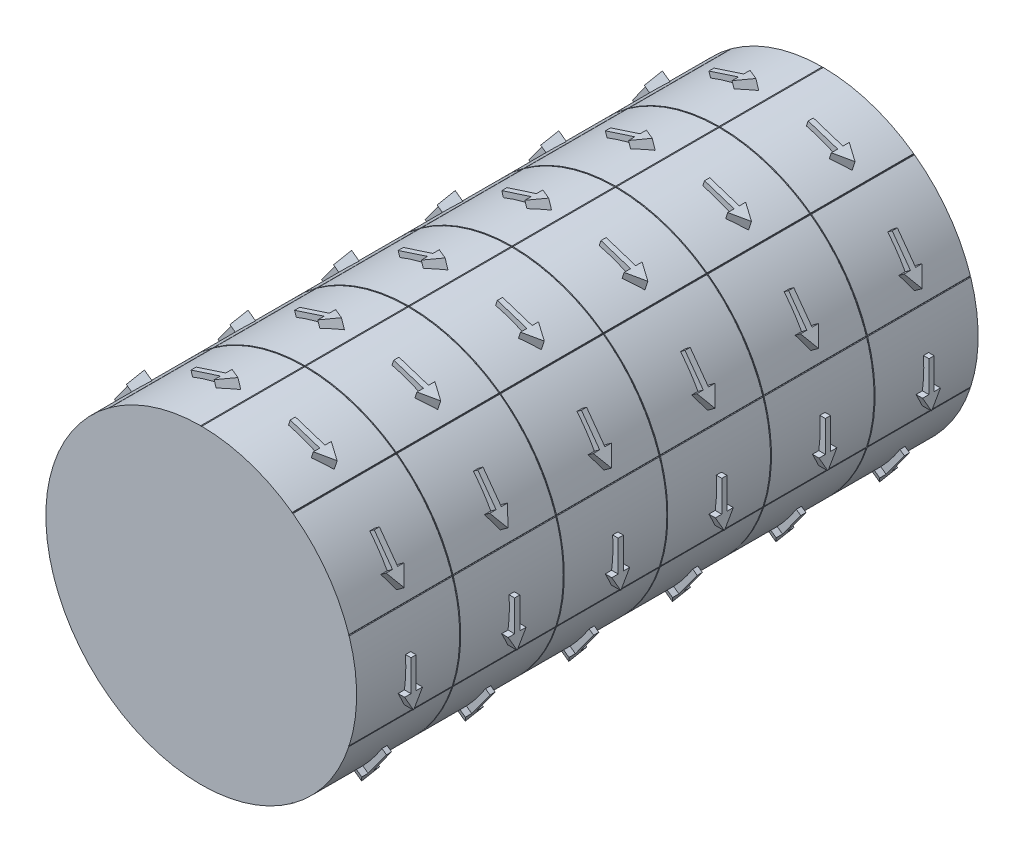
from build123d import *

# Parameters (mm, degrees)
ESQUISSE2_R                          = 15
BOSS_EXTRU_1_DEPTH                   = 60
ENL_V_MAT_EXTRU_1_DEPTH              = 64.639610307
R_P_TITION_CIRCULAIRE1_COUNT         = 10
ESQUISSE4_W                          = 0.1
ESQUISSE4_H                          = 0.1
R_P_TITION_LIN_AIRE1_COUNT           = 5
R_P_TITION_LIN_AIRE1_PITCH           = 10
BOSS_EXTRU_2_START                   = -1
BOSS_EXTRU_2_DEPTH                   = 1.5
R_P_TITION_LIN_AIRE2_COUNT           = 6
R_P_TITION_LIN_AIRE2_PITCH           = 10
R_P_TITION_CIRCULAIRE2_COUNT         = 10
R_P_TITION_START                     = -1
R_P_TITION_CIRCULAIRE2_COPY_1_DEPTH  = 1.5
R_P_TITION_CIRCULAIRE2_COPY_2_DEPTH  = 1.5
R_P_TITION_CIRCULAIRE2_COPY_3_DEPTH  = 1.5
R_P_TITION_CIRCULAIRE2_COPY_4_DEPTH  = 1.5
R_P_TITION_CIRCULAIRE2_COPY_5_DEPTH  = 1.5
R_P_TITION_CIRCULAIRE2_COPY_6_DEPTH  = 1.5
R_P_TITION_CIRCULAIRE2_COPY_7_DEPTH  = 1.5
R_P_TITION_CIRCULAIRE2_COPY_8_DEPTH  = 1.5
R_P_TITION_CIRCULAIRE2_COPY_9_DEPTH  = 1.5
R_P_TITION_CIRCULAIRE2_COPY_10_DEPTH = 1.5
R_P_TITION_CIRCULAIRE2_COPY_11_DEPTH = 1.5
R_P_TITION_CIRCULAIRE2_COPY_12_DEPTH = 1.5
R_P_TITION_CIRCULAIRE2_COPY_13_DEPTH = 1.5
R_P_TITION_CIRCULAIRE2_COPY_14_DEPTH = 1.5
R_P_TITION_CIRCULAIRE2_COPY_15_DEPTH = 1.5
R_P_TITION_CIRCULAIRE2_COPY_16_DEPTH = 1.5
R_P_TITION_CIRCULAIRE2_COPY_17_DEPTH = 1.5
R_P_TITION_CIRCULAIRE2_COPY_18_DEPTH = 1.5
R_P_TITION_CIRCULAIRE2_COPY_19_DEPTH = 1.5
R_P_TITION_CIRCULAIRE2_COPY_20_DEPTH = 1.5
R_P_TITION_CIRCULAIRE2_COPY_21_DEPTH = 1.5
R_P_TITION_CIRCULAIRE2_COPY_22_DEPTH = 1.5
R_P_TITION_CIRCULAIRE2_COPY_23_DEPTH = 1.5
R_P_TITION_CIRCULAIRE2_COPY_24_DEPTH = 1.5
R_P_TITION_CIRCULAIRE2_COPY_25_DEPTH = 1.5
R_P_TITION_CIRCULAIRE2_COPY_26_DEPTH = 1.5
R_P_TITION_CIRCULAIRE2_COPY_27_DEPTH = 1.5
R_P_TITION_CIRCULAIRE2_COPY_28_DEPTH = 1.5
R_P_TITION_CIRCULAIRE2_COPY_29_DEPTH = 1.5
R_P_TITION_CIRCULAIRE2_COPY_30_DEPTH = 1.5
R_P_TITION_CIRCULAIRE2_COPY_31_DEPTH = 1.5
R_P_TITION_CIRCULAIRE2_COPY_32_DEPTH = 1.5
R_P_TITION_CIRCULAIRE2_COPY_33_DEPTH = 1.5
R_P_TITION_CIRCULAIRE2_COPY_34_DEPTH = 1.5
R_P_TITION_CIRCULAIRE2_COPY_35_DEPTH = 1.5
R_P_TITION_CIRCULAIRE2_COPY_36_DEPTH = 1.5
R_P_TITION_CIRCULAIRE2_COPY_37_DEPTH = 1.5
R_P_TITION_CIRCULAIRE2_COPY_38_DEPTH = 1.5
R_P_TITION_CIRCULAIRE2_COPY_39_DEPTH = 1.5
R_P_TITION_CIRCULAIRE2_COPY_40_DEPTH = 1.5
R_P_TITION_CIRCULAIRE2_COPY_41_DEPTH = 1.5
R_P_TITION_CIRCULAIRE2_COPY_42_DEPTH = 1.5
R_P_TITION_CIRCULAIRE2_COPY_43_DEPTH = 1.5
R_P_TITION_CIRCULAIRE2_COPY_44_DEPTH = 1.5
R_P_TITION_CIRCULAIRE2_COPY_45_DEPTH = 1.5


with BuildPart() as part:
    # Esquisse2 → Boss.-Extru.1 (new body)
    with BuildSketch(Plane.XY):
        Circle(ESQUISSE2_R)
    extrude(amount=BOSS_EXTRU_1_DEPTH)

    # Esquisse3 → Enl_v. mat.-Extru.1 (cut, through all)
    with BuildSketch(Plane.XY.offset(60)):
        Polygon((-0.05, 15), (0.05, 15), (0, 14.95), align=None)
    enl_v_mat_extru_1 = extrude(amount=-ENL_V_MAT_EXTRU_1_DEPTH, mode=Mode.SUBTRACT)

    # R_p_tition circulaire1: Enl_v. mat.-Extru.1 ×10 about axis
    r_p_tition_circulaire1_axis = Axis((0, 0, 0), (0, 0, 1))
    for i in range(1, R_P_TITION_CIRCULAIRE1_COUNT):
        add(enl_v_mat_extru_1.rotate(r_p_tition_circulaire1_axis, i * 360 / R_P_TITION_CIRCULAIRE1_COUNT), mode=Mode.SUBTRACT)

    # Esquisse4 → Enl_vement de mati_re-R_volution1 (revolve, cut)
    with BuildSketch(Plane(origin=(0, 0, 0), x_dir=(1, 0, 0), z_dir=(0, 1, 0)), mode=Mode.PRIVATE) as enl_vement_de_mati_re_r_volution1_sk:
        with Locations((-14.95, -10)):
            Rectangle(ESQUISSE4_W, ESQUISSE4_H)
    enl_vement_de_mati_re_r_volution1 = revolve(enl_vement_de_mati_re_r_volution1_sk.sketch.rotate(Axis((0, 0, 0), (0, 0, -1)), 180), axis=Axis((0, 0, 0), (0, 0, -1)), mode=Mode.SUBTRACT)

    # R_p_tition lin_aire1: Enl_vement de mati_re-R_volution1 ×5
    with Locations(*[(0, 0, i * R_P_TITION_LIN_AIRE1_PITCH) for i in range(1, R_P_TITION_LIN_AIRE1_COUNT)]):
        add(enl_vement_de_mati_re_r_volution1, mode=Mode.SUBTRACT)

    # Esquisse5 → Boss.-Extru.2 (add)
    with BuildSketch(Plane(origin=(15, 0, 0), x_dir=(0, 0, -1), z_dir=(1, 0, 0)).offset(BOSS_EXTRU_2_START)):
        Polygon((-55.25, 1), (-54.75, 1), (-54.75, -2), (-54.133974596, -2), (-55, -3.5), (-55.866025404, -2), (-55.25, -2), align=None)
    boss_extru_2 = extrude(amount=BOSS_EXTRU_2_DEPTH)

    # R_p_tition lin_aire2: Boss.-Extru.2 ×6
    with Locations(*[(0, 0, -i * R_P_TITION_LIN_AIRE2_PITCH) for i in range(1, R_P_TITION_LIN_AIRE2_COUNT)]):
        add(boss_extru_2)

    # R_p_tition circulaire2: Boss.-Extru.2 ×10 about axis
    r_p_tition_circulaire2_axis = Axis((0, 0, 0), (0, 0, 1))
    for i in range(1, R_P_TITION_CIRCULAIRE2_COUNT):
        add(boss_extru_2.rotate(r_p_tition_circulaire2_axis, i * 360 / R_P_TITION_CIRCULAIRE2_COUNT))

    # R_p_tition circulaire2 copy 1 sketch → R_p_tition circulaire2 copy 1 (add)
    with BuildSketch(Plane(origin=(12.135254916, 8.816778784, -10), x_dir=(0, 0, -1), z_dir=(0.8090169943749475, 0.5877852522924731, 0)).offset(R_P_TITION_START)):
        Polygon((-55.25, 1), (-54.75, 1), (-54.75, -2), (-54.133974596, -2), (-55, -3.5), (-55.866025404, -2), (-55.25, -2), align=None)
    extrude(amount=R_P_TITION_CIRCULAIRE2_COPY_1_DEPTH)

    # R_p_tition circulaire2 copy 2 sketch → R_p_tition circulaire2 copy 2 (add)
    with BuildSketch(Plane(origin=(4.635254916, 14.265847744, -10), x_dir=(0, 0, -1), z_dir=(0.30901699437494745, 0.9510565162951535, 0)).offset(R_P_TITION_START)):
        Polygon((-55.25, 1), (-54.75, 1), (-54.75, -2), (-54.133974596, -2), (-55, -3.5), (-55.866025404, -2), (-55.25, -2), align=None)
    extrude(amount=R_P_TITION_CIRCULAIRE2_COPY_2_DEPTH)

    # R_p_tition circulaire2 copy 3 sketch → R_p_tition circulaire2 copy 3 (add)
    with BuildSketch(Plane(origin=(-4.635254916, 14.265847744, -10), x_dir=(0, 0, -1), z_dir=(-0.30901699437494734, 0.9510565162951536, 0)).offset(R_P_TITION_START)):
        Polygon((-55.25, 1), (-54.75, 1), (-54.75, -2), (-54.133974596, -2), (-55, -3.5), (-55.866025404, -2), (-55.25, -2), align=None)
    extrude(amount=R_P_TITION_CIRCULAIRE2_COPY_3_DEPTH)

    # R_p_tition circulaire2 copy 4 sketch → R_p_tition circulaire2 copy 4 (add)
    with BuildSketch(Plane(origin=(-12.135254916, 8.816778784, -10), x_dir=(0, 0, -1), z_dir=(-0.8090169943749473, 0.5877852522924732, 0)).offset(R_P_TITION_START)):
        Polygon((-55.25, 1), (-54.75, 1), (-54.75, -2), (-54.133974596, -2), (-55, -3.5), (-55.866025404, -2), (-55.25, -2), align=None)
    extrude(amount=R_P_TITION_CIRCULAIRE2_COPY_4_DEPTH)

    # R_p_tition circulaire2 copy 5 sketch → R_p_tition circulaire2 copy 5 (add)
    with BuildSketch(Plane(origin=(-15, 0, -10), x_dir=(0, 0, -1), z_dir=(-1, 0, 0)).offset(R_P_TITION_START)):
        Polygon((-55.25, 1), (-54.75, 1), (-54.75, -2), (-54.133974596, -2), (-55, -3.5), (-55.866025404, -2), (-55.25, -2), align=None)
    extrude(amount=R_P_TITION_CIRCULAIRE2_COPY_5_DEPTH)

    # R_p_tition circulaire2 copy 6 sketch → R_p_tition circulaire2 copy 6 (add)
    with BuildSketch(Plane(origin=(-12.135254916, -8.816778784, -10), x_dir=(0, 0, -1), z_dir=(-0.8090169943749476, -0.587785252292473, 0)).offset(R_P_TITION_START)):
        Polygon((-55.25, 1), (-54.75, 1), (-54.75, -2), (-54.133974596, -2), (-55, -3.5), (-55.866025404, -2), (-55.25, -2), align=None)
    extrude(amount=R_P_TITION_CIRCULAIRE2_COPY_6_DEPTH)

    # R_p_tition circulaire2 copy 7 sketch → R_p_tition circulaire2 copy 7 (add)
    with BuildSketch(Plane(origin=(-4.635254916, -14.265847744, -10), x_dir=(0, 0, -1), z_dir=(-0.30901699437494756, -0.9510565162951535, 0)).offset(R_P_TITION_START)):
        Polygon((-55.25, 1), (-54.75, 1), (-54.75, -2), (-54.133974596, -2), (-55, -3.5), (-55.866025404, -2), (-55.25, -2), align=None)
    extrude(amount=R_P_TITION_CIRCULAIRE2_COPY_7_DEPTH)

    # R_p_tition circulaire2 copy 8 sketch → R_p_tition circulaire2 copy 8 (add)
    with BuildSketch(Plane(origin=(4.635254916, -14.265847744, -10), x_dir=(0, 0, -1), z_dir=(0.30901699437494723, -0.9510565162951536, 0)).offset(R_P_TITION_START)):
        Polygon((-55.25, 1), (-54.75, 1), (-54.75, -2), (-54.133974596, -2), (-55, -3.5), (-55.866025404, -2), (-55.25, -2), align=None)
    extrude(amount=R_P_TITION_CIRCULAIRE2_COPY_8_DEPTH)

    # R_p_tition circulaire2 copy 9 sketch → R_p_tition circulaire2 copy 9 (add)
    with BuildSketch(Plane(origin=(12.135254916, -8.816778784, -10), x_dir=(0, 0, -1), z_dir=(0.8090169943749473, -0.5877852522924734, 0)).offset(R_P_TITION_START)):
        Polygon((-55.25, 1), (-54.75, 1), (-54.75, -2), (-54.133974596, -2), (-55, -3.5), (-55.866025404, -2), (-55.25, -2), align=None)
    extrude(amount=R_P_TITION_CIRCULAIRE2_COPY_9_DEPTH)

    # R_p_tition circulaire2 copy 10 sketch → R_p_tition circulaire2 copy 10 (add)
    with BuildSketch(Plane(origin=(12.135254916, 8.816778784, -20), x_dir=(0, 0, -1), z_dir=(0.8090169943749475, 0.5877852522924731, 0)).offset(R_P_TITION_START)):
        Polygon((-55.25, 1), (-54.75, 1), (-54.75, -2), (-54.133974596, -2), (-55, -3.5), (-55.866025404, -2), (-55.25, -2), align=None)
    extrude(amount=R_P_TITION_CIRCULAIRE2_COPY_10_DEPTH)

    # R_p_tition circulaire2 copy 11 sketch → R_p_tition circulaire2 copy 11 (add)
    with BuildSketch(Plane(origin=(4.635254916, 14.265847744, -20), x_dir=(0, 0, -1), z_dir=(0.30901699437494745, 0.9510565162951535, 0)).offset(R_P_TITION_START)):
        Polygon((-55.25, 1), (-54.75, 1), (-54.75, -2), (-54.133974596, -2), (-55, -3.5), (-55.866025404, -2), (-55.25, -2), align=None)
    extrude(amount=R_P_TITION_CIRCULAIRE2_COPY_11_DEPTH)

    # R_p_tition circulaire2 copy 12 sketch → R_p_tition circulaire2 copy 12 (add)
    with BuildSketch(Plane(origin=(-4.635254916, 14.265847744, -20), x_dir=(0, 0, -1), z_dir=(-0.30901699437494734, 0.9510565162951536, 0)).offset(R_P_TITION_START)):
        Polygon((-55.25, 1), (-54.75, 1), (-54.75, -2), (-54.133974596, -2), (-55, -3.5), (-55.866025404, -2), (-55.25, -2), align=None)
    extrude(amount=R_P_TITION_CIRCULAIRE2_COPY_12_DEPTH)

    # R_p_tition circulaire2 copy 13 sketch → R_p_tition circulaire2 copy 13 (add)
    with BuildSketch(Plane(origin=(-12.135254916, 8.816778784, -20), x_dir=(0, 0, -1), z_dir=(-0.8090169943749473, 0.5877852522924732, 0)).offset(R_P_TITION_START)):
        Polygon((-55.25, 1), (-54.75, 1), (-54.75, -2), (-54.133974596, -2), (-55, -3.5), (-55.866025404, -2), (-55.25, -2), align=None)
    extrude(amount=R_P_TITION_CIRCULAIRE2_COPY_13_DEPTH)

    # R_p_tition circulaire2 copy 14 sketch → R_p_tition circulaire2 copy 14 (add)
    with BuildSketch(Plane(origin=(-15, 0, -20), x_dir=(0, 0, -1), z_dir=(-1, 0, 0)).offset(R_P_TITION_START)):
        Polygon((-55.25, 1), (-54.75, 1), (-54.75, -2), (-54.133974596, -2), (-55, -3.5), (-55.866025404, -2), (-55.25, -2), align=None)
    extrude(amount=R_P_TITION_CIRCULAIRE2_COPY_14_DEPTH)

    # R_p_tition circulaire2 copy 15 sketch → R_p_tition circulaire2 copy 15 (add)
    with BuildSketch(Plane(origin=(-12.135254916, -8.816778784, -20), x_dir=(0, 0, -1), z_dir=(-0.8090169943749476, -0.587785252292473, 0)).offset(R_P_TITION_START)):
        Polygon((-55.25, 1), (-54.75, 1), (-54.75, -2), (-54.133974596, -2), (-55, -3.5), (-55.866025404, -2), (-55.25, -2), align=None)
    extrude(amount=R_P_TITION_CIRCULAIRE2_COPY_15_DEPTH)

    # R_p_tition circulaire2 copy 16 sketch → R_p_tition circulaire2 copy 16 (add)
    with BuildSketch(Plane(origin=(-4.635254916, -14.265847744, -20), x_dir=(0, 0, -1), z_dir=(-0.30901699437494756, -0.9510565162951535, 0)).offset(R_P_TITION_START)):
        Polygon((-55.25, 1), (-54.75, 1), (-54.75, -2), (-54.133974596, -2), (-55, -3.5), (-55.866025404, -2), (-55.25, -2), align=None)
    extrude(amount=R_P_TITION_CIRCULAIRE2_COPY_16_DEPTH)

    # R_p_tition circulaire2 copy 17 sketch → R_p_tition circulaire2 copy 17 (add)
    with BuildSketch(Plane(origin=(4.635254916, -14.265847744, -20), x_dir=(0, 0, -1), z_dir=(0.30901699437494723, -0.9510565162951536, 0)).offset(R_P_TITION_START)):
        Polygon((-55.25, 1), (-54.75, 1), (-54.75, -2), (-54.133974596, -2), (-55, -3.5), (-55.866025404, -2), (-55.25, -2), align=None)
    extrude(amount=R_P_TITION_CIRCULAIRE2_COPY_17_DEPTH)

    # R_p_tition circulaire2 copy 18 sketch → R_p_tition circulaire2 copy 18 (add)
    with BuildSketch(Plane(origin=(12.135254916, -8.816778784, -20), x_dir=(0, 0, -1), z_dir=(0.8090169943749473, -0.5877852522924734, 0)).offset(R_P_TITION_START)):
        Polygon((-55.25, 1), (-54.75, 1), (-54.75, -2), (-54.133974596, -2), (-55, -3.5), (-55.866025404, -2), (-55.25, -2), align=None)
    extrude(amount=R_P_TITION_CIRCULAIRE2_COPY_18_DEPTH)

    # R_p_tition circulaire2 copy 19 sketch → R_p_tition circulaire2 copy 19 (add)
    with BuildSketch(Plane(origin=(12.135254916, 8.816778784, -30), x_dir=(0, 0, -1), z_dir=(0.8090169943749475, 0.5877852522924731, 0)).offset(R_P_TITION_START)):
        Polygon((-55.25, 1), (-54.75, 1), (-54.75, -2), (-54.133974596, -2), (-55, -3.5), (-55.866025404, -2), (-55.25, -2), align=None)
    extrude(amount=R_P_TITION_CIRCULAIRE2_COPY_19_DEPTH)

    # R_p_tition circulaire2 copy 20 sketch → R_p_tition circulaire2 copy 20 (add)
    with BuildSketch(Plane(origin=(4.635254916, 14.265847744, -30), x_dir=(0, 0, -1), z_dir=(0.30901699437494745, 0.9510565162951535, 0)).offset(R_P_TITION_START)):
        Polygon((-55.25, 1), (-54.75, 1), (-54.75, -2), (-54.133974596, -2), (-55, -3.5), (-55.866025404, -2), (-55.25, -2), align=None)
    extrude(amount=R_P_TITION_CIRCULAIRE2_COPY_20_DEPTH)

    # R_p_tition circulaire2 copy 21 sketch → R_p_tition circulaire2 copy 21 (add)
    with BuildSketch(Plane(origin=(-4.635254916, 14.265847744, -30), x_dir=(0, 0, -1), z_dir=(-0.30901699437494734, 0.9510565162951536, 0)).offset(R_P_TITION_START)):
        Polygon((-55.25, 1), (-54.75, 1), (-54.75, -2), (-54.133974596, -2), (-55, -3.5), (-55.866025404, -2), (-55.25, -2), align=None)
    extrude(amount=R_P_TITION_CIRCULAIRE2_COPY_21_DEPTH)

    # R_p_tition circulaire2 copy 22 sketch → R_p_tition circulaire2 copy 22 (add)
    with BuildSketch(Plane(origin=(-12.135254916, 8.816778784, -30), x_dir=(0, 0, -1), z_dir=(-0.8090169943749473, 0.5877852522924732, 0)).offset(R_P_TITION_START)):
        Polygon((-55.25, 1), (-54.75, 1), (-54.75, -2), (-54.133974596, -2), (-55, -3.5), (-55.866025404, -2), (-55.25, -2), align=None)
    extrude(amount=R_P_TITION_CIRCULAIRE2_COPY_22_DEPTH)

    # R_p_tition circulaire2 copy 23 sketch → R_p_tition circulaire2 copy 23 (add)
    with BuildSketch(Plane(origin=(-15, 0, -30), x_dir=(0, 0, -1), z_dir=(-1, 0, 0)).offset(R_P_TITION_START)):
        Polygon((-55.25, 1), (-54.75, 1), (-54.75, -2), (-54.133974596, -2), (-55, -3.5), (-55.866025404, -2), (-55.25, -2), align=None)
    extrude(amount=R_P_TITION_CIRCULAIRE2_COPY_23_DEPTH)

    # R_p_tition circulaire2 copy 24 sketch → R_p_tition circulaire2 copy 24 (add)
    with BuildSketch(Plane(origin=(-12.135254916, -8.816778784, -30), x_dir=(0, 0, -1), z_dir=(-0.8090169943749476, -0.587785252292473, 0)).offset(R_P_TITION_START)):
        Polygon((-55.25, 1), (-54.75, 1), (-54.75, -2), (-54.133974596, -2), (-55, -3.5), (-55.866025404, -2), (-55.25, -2), align=None)
    extrude(amount=R_P_TITION_CIRCULAIRE2_COPY_24_DEPTH)

    # R_p_tition circulaire2 copy 25 sketch → R_p_tition circulaire2 copy 25 (add)
    with BuildSketch(Plane(origin=(-4.635254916, -14.265847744, -30), x_dir=(0, 0, -1), z_dir=(-0.30901699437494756, -0.9510565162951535, 0)).offset(R_P_TITION_START)):
        Polygon((-55.25, 1), (-54.75, 1), (-54.75, -2), (-54.133974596, -2), (-55, -3.5), (-55.866025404, -2), (-55.25, -2), align=None)
    extrude(amount=R_P_TITION_CIRCULAIRE2_COPY_25_DEPTH)

    # R_p_tition circulaire2 copy 26 sketch → R_p_tition circulaire2 copy 26 (add)
    with BuildSketch(Plane(origin=(4.635254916, -14.265847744, -30), x_dir=(0, 0, -1), z_dir=(0.30901699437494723, -0.9510565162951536, 0)).offset(R_P_TITION_START)):
        Polygon((-55.25, 1), (-54.75, 1), (-54.75, -2), (-54.133974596, -2), (-55, -3.5), (-55.866025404, -2), (-55.25, -2), align=None)
    extrude(amount=R_P_TITION_CIRCULAIRE2_COPY_26_DEPTH)

    # R_p_tition circulaire2 copy 27 sketch → R_p_tition circulaire2 copy 27 (add)
    with BuildSketch(Plane(origin=(12.135254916, -8.816778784, -30), x_dir=(0, 0, -1), z_dir=(0.8090169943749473, -0.5877852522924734, 0)).offset(R_P_TITION_START)):
        Polygon((-55.25, 1), (-54.75, 1), (-54.75, -2), (-54.133974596, -2), (-55, -3.5), (-55.866025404, -2), (-55.25, -2), align=None)
    extrude(amount=R_P_TITION_CIRCULAIRE2_COPY_27_DEPTH)

    # R_p_tition circulaire2 copy 28 sketch → R_p_tition circulaire2 copy 28 (add)
    with BuildSketch(Plane(origin=(12.135254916, 8.816778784, -40), x_dir=(0, 0, -1), z_dir=(0.8090169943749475, 0.5877852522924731, 0)).offset(R_P_TITION_START)):
        Polygon((-55.25, 1), (-54.75, 1), (-54.75, -2), (-54.133974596, -2), (-55, -3.5), (-55.866025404, -2), (-55.25, -2), align=None)
    extrude(amount=R_P_TITION_CIRCULAIRE2_COPY_28_DEPTH)

    # R_p_tition circulaire2 copy 29 sketch → R_p_tition circulaire2 copy 29 (add)
    with BuildSketch(Plane(origin=(4.635254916, 14.265847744, -40), x_dir=(0, 0, -1), z_dir=(0.30901699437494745, 0.9510565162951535, 0)).offset(R_P_TITION_START)):
        Polygon((-55.25, 1), (-54.75, 1), (-54.75, -2), (-54.133974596, -2), (-55, -3.5), (-55.866025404, -2), (-55.25, -2), align=None)
    extrude(amount=R_P_TITION_CIRCULAIRE2_COPY_29_DEPTH)

    # R_p_tition circulaire2 copy 30 sketch → R_p_tition circulaire2 copy 30 (add)
    with BuildSketch(Plane(origin=(-4.635254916, 14.265847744, -40), x_dir=(0, 0, -1), z_dir=(-0.30901699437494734, 0.9510565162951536, 0)).offset(R_P_TITION_START)):
        Polygon((-55.25, 1), (-54.75, 1), (-54.75, -2), (-54.133974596, -2), (-55, -3.5), (-55.866025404, -2), (-55.25, -2), align=None)
    extrude(amount=R_P_TITION_CIRCULAIRE2_COPY_30_DEPTH)

    # R_p_tition circulaire2 copy 31 sketch → R_p_tition circulaire2 copy 31 (add)
    with BuildSketch(Plane(origin=(-12.135254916, 8.816778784, -40), x_dir=(0, 0, -1), z_dir=(-0.8090169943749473, 0.5877852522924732, 0)).offset(R_P_TITION_START)):
        Polygon((-55.25, 1), (-54.75, 1), (-54.75, -2), (-54.133974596, -2), (-55, -3.5), (-55.866025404, -2), (-55.25, -2), align=None)
    extrude(amount=R_P_TITION_CIRCULAIRE2_COPY_31_DEPTH)

    # R_p_tition circulaire2 copy 32 sketch → R_p_tition circulaire2 copy 32 (add)
    with BuildSketch(Plane(origin=(-15, 0, -40), x_dir=(0, 0, -1), z_dir=(-1, 0, 0)).offset(R_P_TITION_START)):
        Polygon((-55.25, 1), (-54.75, 1), (-54.75, -2), (-54.133974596, -2), (-55, -3.5), (-55.866025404, -2), (-55.25, -2), align=None)
    extrude(amount=R_P_TITION_CIRCULAIRE2_COPY_32_DEPTH)

    # R_p_tition circulaire2 copy 33 sketch → R_p_tition circulaire2 copy 33 (add)
    with BuildSketch(Plane(origin=(-12.135254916, -8.816778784, -40), x_dir=(0, 0, -1), z_dir=(-0.8090169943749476, -0.587785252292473, 0)).offset(R_P_TITION_START)):
        Polygon((-55.25, 1), (-54.75, 1), (-54.75, -2), (-54.133974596, -2), (-55, -3.5), (-55.866025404, -2), (-55.25, -2), align=None)
    extrude(amount=R_P_TITION_CIRCULAIRE2_COPY_33_DEPTH)

    # R_p_tition circulaire2 copy 34 sketch → R_p_tition circulaire2 copy 34 (add)
    with BuildSketch(Plane(origin=(-4.635254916, -14.265847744, -40), x_dir=(0, 0, -1), z_dir=(-0.30901699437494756, -0.9510565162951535, 0)).offset(R_P_TITION_START)):
        Polygon((-55.25, 1), (-54.75, 1), (-54.75, -2), (-54.133974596, -2), (-55, -3.5), (-55.866025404, -2), (-55.25, -2), align=None)
    extrude(amount=R_P_TITION_CIRCULAIRE2_COPY_34_DEPTH)

    # R_p_tition circulaire2 copy 35 sketch → R_p_tition circulaire2 copy 35 (add)
    with BuildSketch(Plane(origin=(4.635254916, -14.265847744, -40), x_dir=(0, 0, -1), z_dir=(0.30901699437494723, -0.9510565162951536, 0)).offset(R_P_TITION_START)):
        Polygon((-55.25, 1), (-54.75, 1), (-54.75, -2), (-54.133974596, -2), (-55, -3.5), (-55.866025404, -2), (-55.25, -2), align=None)
    extrude(amount=R_P_TITION_CIRCULAIRE2_COPY_35_DEPTH)

    # R_p_tition circulaire2 copy 36 sketch → R_p_tition circulaire2 copy 36 (add)
    with BuildSketch(Plane(origin=(12.135254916, -8.816778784, -40), x_dir=(0, 0, -1), z_dir=(0.8090169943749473, -0.5877852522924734, 0)).offset(R_P_TITION_START)):
        Polygon((-55.25, 1), (-54.75, 1), (-54.75, -2), (-54.133974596, -2), (-55, -3.5), (-55.866025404, -2), (-55.25, -2), align=None)
    extrude(amount=R_P_TITION_CIRCULAIRE2_COPY_36_DEPTH)

    # R_p_tition circulaire2 copy 37 sketch → R_p_tition circulaire2 copy 37 (add)
    with BuildSketch(Plane(origin=(12.135254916, 8.816778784, -50), x_dir=(0, 0, -1), z_dir=(0.8090169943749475, 0.5877852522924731, 0)).offset(R_P_TITION_START)):
        Polygon((-55.25, 1), (-54.75, 1), (-54.75, -2), (-54.133974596, -2), (-55, -3.5), (-55.866025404, -2), (-55.25, -2), align=None)
    extrude(amount=R_P_TITION_CIRCULAIRE2_COPY_37_DEPTH)

    # R_p_tition circulaire2 copy 38 sketch → R_p_tition circulaire2 copy 38 (add)
    with BuildSketch(Plane(origin=(4.635254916, 14.265847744, -50), x_dir=(0, 0, -1), z_dir=(0.30901699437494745, 0.9510565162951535, 0)).offset(R_P_TITION_START)):
        Polygon((-55.25, 1), (-54.75, 1), (-54.75, -2), (-54.133974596, -2), (-55, -3.5), (-55.866025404, -2), (-55.25, -2), align=None)
    extrude(amount=R_P_TITION_CIRCULAIRE2_COPY_38_DEPTH)

    # R_p_tition circulaire2 copy 39 sketch → R_p_tition circulaire2 copy 39 (add)
    with BuildSketch(Plane(origin=(-4.635254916, 14.265847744, -50), x_dir=(0, 0, -1), z_dir=(-0.30901699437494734, 0.9510565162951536, 0)).offset(R_P_TITION_START)):
        Polygon((-55.25, 1), (-54.75, 1), (-54.75, -2), (-54.133974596, -2), (-55, -3.5), (-55.866025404, -2), (-55.25, -2), align=None)
    extrude(amount=R_P_TITION_CIRCULAIRE2_COPY_39_DEPTH)

    # R_p_tition circulaire2 copy 40 sketch → R_p_tition circulaire2 copy 40 (add)
    with BuildSketch(Plane(origin=(-12.135254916, 8.816778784, -50), x_dir=(0, 0, -1), z_dir=(-0.8090169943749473, 0.5877852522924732, 0)).offset(R_P_TITION_START)):
        Polygon((-55.25, 1), (-54.75, 1), (-54.75, -2), (-54.133974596, -2), (-55, -3.5), (-55.866025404, -2), (-55.25, -2), align=None)
    extrude(amount=R_P_TITION_CIRCULAIRE2_COPY_40_DEPTH)

    # R_p_tition circulaire2 copy 41 sketch → R_p_tition circulaire2 copy 41 (add)
    with BuildSketch(Plane(origin=(-15, 0, -50), x_dir=(0, 0, -1), z_dir=(-1, 0, 0)).offset(R_P_TITION_START)):
        Polygon((-55.25, 1), (-54.75, 1), (-54.75, -2), (-54.133974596, -2), (-55, -3.5), (-55.866025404, -2), (-55.25, -2), align=None)
    extrude(amount=R_P_TITION_CIRCULAIRE2_COPY_41_DEPTH)

    # R_p_tition circulaire2 copy 42 sketch → R_p_tition circulaire2 copy 42 (add)
    with BuildSketch(Plane(origin=(-12.135254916, -8.816778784, -50), x_dir=(0, 0, -1), z_dir=(-0.8090169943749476, -0.587785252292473, 0)).offset(R_P_TITION_START)):
        Polygon((-55.25, 1), (-54.75, 1), (-54.75, -2), (-54.133974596, -2), (-55, -3.5), (-55.866025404, -2), (-55.25, -2), align=None)
    extrude(amount=R_P_TITION_CIRCULAIRE2_COPY_42_DEPTH)

    # R_p_tition circulaire2 copy 43 sketch → R_p_tition circulaire2 copy 43 (add)
    with BuildSketch(Plane(origin=(-4.635254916, -14.265847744, -50), x_dir=(0, 0, -1), z_dir=(-0.30901699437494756, -0.9510565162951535, 0)).offset(R_P_TITION_START)):
        Polygon((-55.25, 1), (-54.75, 1), (-54.75, -2), (-54.133974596, -2), (-55, -3.5), (-55.866025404, -2), (-55.25, -2), align=None)
    extrude(amount=R_P_TITION_CIRCULAIRE2_COPY_43_DEPTH)

    # R_p_tition circulaire2 copy 44 sketch → R_p_tition circulaire2 copy 44 (add)
    with BuildSketch(Plane(origin=(4.635254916, -14.265847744, -50), x_dir=(0, 0, -1), z_dir=(0.30901699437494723, -0.9510565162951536, 0)).offset(R_P_TITION_START)):
        Polygon((-55.25, 1), (-54.75, 1), (-54.75, -2), (-54.133974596, -2), (-55, -3.5), (-55.866025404, -2), (-55.25, -2), align=None)
    extrude(amount=R_P_TITION_CIRCULAIRE2_COPY_44_DEPTH)

    # R_p_tition circulaire2 copy 45 sketch → R_p_tition circulaire2 copy 45 (add)
    with BuildSketch(Plane(origin=(12.135254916, -8.816778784, -50), x_dir=(0, 0, -1), z_dir=(0.8090169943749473, -0.5877852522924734, 0)).offset(R_P_TITION_START)):
        Polygon((-55.25, 1), (-54.75, 1), (-54.75, -2), (-54.133974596, -2), (-55, -3.5), (-55.866025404, -2), (-55.25, -2), align=None)
    extrude(amount=R_P_TITION_CIRCULAIRE2_COPY_45_DEPTH)


solid = part.part
